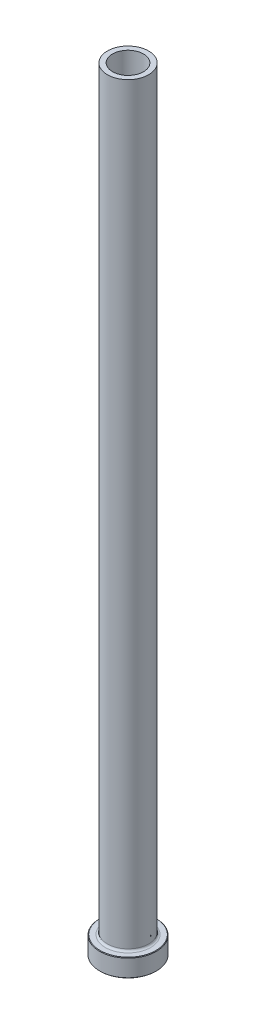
from build123d import *

# Parameters (mm, degrees)
FILLET1_R     = 0.8
CHAMFER1_SIZE = 0.2
CHAMFER3_SIZE = 0.5


with BuildPart() as part:
    # Sketch1 → Revolve1 (revolve)
    with BuildSketch(Plane.XY, mode=Mode.PRIVATE) as revolve1_sk:
        Polygon((-6, 300), (-8, 300), (-8, 7), (-11, 7), (-11, 0), (-6.25, 0), (-6.25, 233), (-6, 245), align=None)
    revolve(revolve1_sk.sketch.rotate(Axis((0, 92.187680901, 0), (0, -1, 0)), 270), axis=Axis((0, 92.187680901, 0), (0, -1, 0)))

    # Fillet1
    fillet1_edges = [part.edges().sort_by_distance(p)[0] for p in [
        (0, 7, -8),
    ]]
    fillet(fillet1_edges, radius=FILLET1_R)

    # Chamfer1
    chamfer1_edges = [part.edges().sort_by_distance(p)[0] for p in [
        (0, 0, -11),
        (0, 7, -11),
    ]]
    chamfer(chamfer1_edges, length=CHAMFER1_SIZE)

    # Chamfer3
    chamfer3_edges = [part.edges().sort_by_distance(p)[0] for p in [
        (0, 0, -6.25),
    ]]
    chamfer(chamfer3_edges, length=CHAMFER3_SIZE)


solid = part.part
